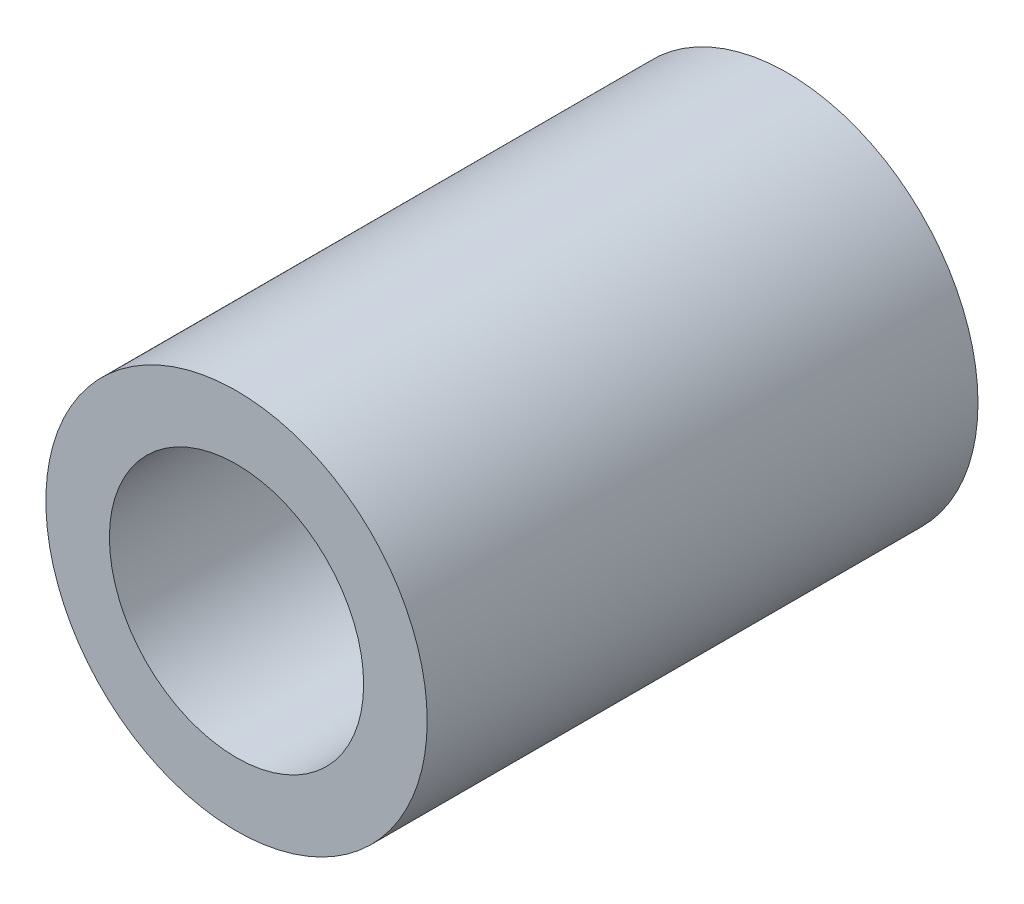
ISO-10303-21;
HEADER;
FILE_DESCRIPTION(('STEP AP214'),'2;1');
FILE_NAME('part.step','',(''),(''),'','','');
FILE_SCHEMA(('AUTOMOTIVE_DESIGN { 1 0 10303 214 1 1 1 1 }'));
ENDSEC;
DATA;
#1=APPLICATION_CONTEXT('core data for automotive mechanical design processes');
#2=APPLICATION_PROTOCOL_DEFINITION('international standard','automotive_design',2000,#1);
#3=PRODUCT_CONTEXT('',#1,'mechanical');
#4=PRODUCT('Part','Part','',(#3));
#5=PRODUCT_RELATED_PRODUCT_CATEGORY('part','',(#4));
#6=PRODUCT_DEFINITION_FORMATION('','',#4);
#7=PRODUCT_DEFINITION_CONTEXT('part definition',#1,'design');
#8=PRODUCT_DEFINITION('design','',#6,#7);
#9=PRODUCT_DEFINITION_SHAPE('','',#8);
#10=(LENGTH_UNIT() NAMED_UNIT(*) SI_UNIT(.MILLI.,.METRE.));
#11=(NAMED_UNIT(*) PLANE_ANGLE_UNIT() SI_UNIT($,.RADIAN.));
#12=(NAMED_UNIT(*) SI_UNIT($,.STERADIAN.) SOLID_ANGLE_UNIT());
#13=UNCERTAINTY_MEASURE_WITH_UNIT(LENGTH_MEASURE(1.E-05),#10,'distance_accuracy_value','');
#14=(GEOMETRIC_REPRESENTATION_CONTEXT(3) GLOBAL_UNCERTAINTY_ASSIGNED_CONTEXT((#13)) GLOBAL_UNIT_ASSIGNED_CONTEXT((#10,
#11,#12)) REPRESENTATION_CONTEXT('',''));
#15=CARTESIAN_POINT('',(0.,0.,0.));
#16=DIRECTION('',(0.,0.,1.));
#17=DIRECTION('',(1.,0.,0.));
#18=AXIS2_PLACEMENT_3D('',#15,#16,#17);
#19=CARTESIAN_POINT('',(0.,0.,32.5));
#20=DIRECTION('',(0.,0.,1.));
#21=DIRECTION('',(1.,0.,0.));
#22=AXIS2_PLACEMENT_3D('',#19,#20,#21);
#23=PLANE('',#22);
#24=CARTESIAN_POINT('',(0.,0.,32.5));
#25=DIRECTION('',(0.,0.,1.));
#26=DIRECTION('',(1.,0.,0.));
#27=AXIS2_PLACEMENT_3D('',#24,#25,#26);
#28=CIRCLE('',#27,22.5);
#29=CARTESIAN_POINT('',(22.5,0.,32.5));
#30=VERTEX_POINT('',#29);
#31=EDGE_CURVE('E10',#30,#30,#28,.T.);
#32=ORIENTED_EDGE('',*,*,#31,.T.);
#33=EDGE_LOOP('',(#32));
#34=FACE_BOUND('',#33,.T.);
#35=CARTESIAN_POINT('',(0.,0.,32.5));
#36=DIRECTION('',(0.,0.,1.));
#37=DIRECTION('',(1.,0.,0.));
#38=AXIS2_PLACEMENT_3D('',#35,#36,#37);
#39=CIRCLE('',#38,15.);
#40=CARTESIAN_POINT('',(15.,0.,32.5));
#41=VERTEX_POINT('',#40);
#42=EDGE_CURVE('E56',#41,#41,#39,.T.);
#43=ORIENTED_EDGE('',*,*,#42,.F.);
#44=EDGE_LOOP('',(#43));
#45=FACE_BOUND('',#44,.T.);
#46=ADVANCED_FACE('F37',(#34,#45),#23,.T.);
#47=CARTESIAN_POINT('',(0.,0.,-32.5));
#48=DIRECTION('',(0.,0.,1.));
#49=DIRECTION('',(1.,0.,0.));
#50=AXIS2_PLACEMENT_3D('',#47,#48,#49);
#51=PLANE('',#50);
#52=CARTESIAN_POINT('',(0.,0.,-32.5));
#53=DIRECTION('',(0.,0.,1.));
#54=DIRECTION('',(1.,0.,0.));
#55=AXIS2_PLACEMENT_3D('',#52,#53,#54);
#56=CIRCLE('',#55,22.5);
#57=CARTESIAN_POINT('',(22.5,0.,-32.5));
#58=VERTEX_POINT('',#57);
#59=EDGE_CURVE('E51',#58,#58,#56,.T.);
#60=ORIENTED_EDGE('',*,*,#59,.F.);
#61=EDGE_LOOP('',(#60));
#62=FACE_BOUND('',#61,.T.);
#63=CARTESIAN_POINT('',(0.,0.,-32.5));
#64=DIRECTION('',(0.,0.,1.));
#65=DIRECTION('',(1.,0.,0.));
#66=AXIS2_PLACEMENT_3D('',#63,#64,#65);
#67=CIRCLE('',#66,15.);
#68=CARTESIAN_POINT('',(15.,0.,-32.5));
#69=VERTEX_POINT('',#68);
#70=EDGE_CURVE('E58',#69,#69,#67,.T.);
#71=ORIENTED_EDGE('',*,*,#70,.T.);
#72=EDGE_LOOP('',(#71));
#73=FACE_BOUND('',#72,.T.);
#74=ADVANCED_FACE('F79',(#62,#73),#51,.F.);
#75=CARTESIAN_POINT('',(0.,0.,32.5));
#76=DIRECTION('',(0.,0.,-1.));
#77=DIRECTION('',(-1.,0.,0.));
#78=AXIS2_PLACEMENT_3D('',#75,#76,#77);
#79=CYLINDRICAL_SURFACE('',#78,22.5);
#80=CARTESIAN_POINT('',(0.,-22.5,4.));
#81=CARTESIAN_POINT('',(0.222799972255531,-22.499996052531,3.99999127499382));
#82=CARTESIAN_POINT('',(0.44571593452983,-22.4966563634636,3.98132216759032));
#83=CARTESIAN_POINT('',(0.885280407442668,-22.4836554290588,3.90717888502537));
#84=CARTESIAN_POINT('',(1.10192322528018,-22.4739886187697,3.85167230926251));
#85=CARTESIAN_POINT('',(1.52251954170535,-22.4494161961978,3.70559573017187));
#86=CARTESIAN_POINT('',(1.72648380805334,-22.4345151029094,3.61505596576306));
#87=CARTESIAN_POINT('',(2.11630409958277,-22.4011066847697,3.40156580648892));
#88=CARTESIAN_POINT('',(2.30216187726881,-22.3825997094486,3.27861855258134));
#89=CARTESIAN_POINT('',(2.65252607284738,-22.3438026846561,3.00239027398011));
#90=CARTESIAN_POINT('',(2.81680824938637,-22.3234971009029,2.84882697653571));
#91=CARTESIAN_POINT('',(3.11741933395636,-22.2835084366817,2.51633313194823));
#92=CARTESIAN_POINT('',(3.25374635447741,-22.2638253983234,2.33740087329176));
#93=CARTESIAN_POINT('',(3.49549375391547,-22.2271597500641,1.95768473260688));
#94=CARTESIAN_POINT('',(3.60068906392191,-22.2101971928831,1.75675545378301));
#95=CARTESIAN_POINT('',(3.7757468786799,-22.181110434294,1.33972525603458));
#96=CARTESIAN_POINT('',(3.84561211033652,-22.168985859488,1.12362550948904));
#97=CARTESIAN_POINT('',(3.94731313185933,-22.1511034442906,0.684777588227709));
#98=CARTESIAN_POINT('',(3.9795381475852,-22.1452804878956,0.462122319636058));
#99=CARTESIAN_POINT('',(4.00625148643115,-22.1404639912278,0.0144948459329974));
#100=CARTESIAN_POINT('',(4.00074284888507,-22.1414699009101,-0.210477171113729));
#101=CARTESIAN_POINT('',(3.95246154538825,-22.1501381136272,-0.653552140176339));
#102=CARTESIAN_POINT('',(3.91012888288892,-22.1577218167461,-0.871704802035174));
#103=CARTESIAN_POINT('',(3.79009297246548,-22.1785678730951,-1.29776134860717));
#104=CARTESIAN_POINT('',(3.71238836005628,-22.1918304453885,-1.50566483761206));
#105=CARTESIAN_POINT('',(3.52337643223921,-22.2226233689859,-1.90662315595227));
#106=CARTESIAN_POINT('',(3.41188903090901,-22.2401764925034,-2.09959127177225));
#107=CARTESIAN_POINT('',(3.15860383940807,-22.2775573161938,-2.46424740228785));
#108=CARTESIAN_POINT('',(3.0168032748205,-22.2973852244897,-2.63593346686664));
#109=CARTESIAN_POINT('',(2.70453259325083,-22.3374253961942,-2.9556964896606));
#110=CARTESIAN_POINT('',(2.53368555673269,-22.357639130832,-3.10340542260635));
#111=CARTESIAN_POINT('',(2.16943936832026,-22.3959150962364,-3.36811804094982));
#112=CARTESIAN_POINT('',(1.97604003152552,-22.4139773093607,-3.48512147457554));
#113=CARTESIAN_POINT('',(1.5718134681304,-22.4459461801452,-3.68514599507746));
#114=CARTESIAN_POINT('',(1.36096830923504,-22.4598484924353,-3.76813158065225));
#115=CARTESIAN_POINT('',(0.928029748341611,-22.48189700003,-3.89740740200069));
#116=CARTESIAN_POINT('',(0.705937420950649,-22.4900437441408,-3.94370113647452));
#117=CARTESIAN_POINT('',(0.259977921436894,-22.4995885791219,-3.99777331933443));
#118=CARTESIAN_POINT('',(0.0361737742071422,-22.5010750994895,-4.00605647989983));
#119=CARTESIAN_POINT('',(-0.409622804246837,-22.4973752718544,-3.9852222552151));
#120=CARTESIAN_POINT('',(-0.631615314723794,-22.4921892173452,-3.95610651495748));
#121=CARTESIAN_POINT('',(-1.06590632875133,-22.4757818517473,-3.86172071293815));
#122=CARTESIAN_POINT('',(-1.27826149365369,-22.4646027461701,-3.79670338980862));
#123=CARTESIAN_POINT('',(-1.68905751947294,-22.4374575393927,-3.63263156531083));
#124=CARTESIAN_POINT('',(-1.88749751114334,-22.4214911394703,-3.533574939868));
#125=CARTESIAN_POINT('',(-2.26700267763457,-22.386322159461,-3.30310064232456));
#126=CARTESIAN_POINT('',(-2.44787566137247,-22.3670890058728,-3.1713712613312));
#127=CARTESIAN_POINT('',(-2.78512961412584,-22.327604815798,-2.87971589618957));
#128=CARTESIAN_POINT('',(-2.94150854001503,-22.3073536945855,-2.71978756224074));
#129=CARTESIAN_POINT('',(-3.22723071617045,-22.2678261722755,-2.37399912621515));
#130=CARTESIAN_POINT('',(-3.35623113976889,-22.2485641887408,-2.18785383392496));
#131=CARTESIAN_POINT('',(-3.58113186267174,-22.213475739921,-1.79623885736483));
#132=CARTESIAN_POINT('',(-3.67703331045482,-22.1976491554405,-1.59076984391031));
#133=CARTESIAN_POINT('',(-3.83251482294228,-22.1713342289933,-1.16725262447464));
#134=CARTESIAN_POINT('',(-3.89225850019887,-22.1608218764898,-0.949266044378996));
#135=CARTESIAN_POINT('',(-3.9742383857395,-22.1462681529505,-0.506146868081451));
#136=CARTESIAN_POINT('',(-3.99647835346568,-22.1422261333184,-0.281014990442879));
#137=CARTESIAN_POINT('',(-4.00270371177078,-22.1411012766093,0.166575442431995));
#138=CARTESIAN_POINT('',(-3.98722928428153,-22.1439201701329,0.389026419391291));
#139=CARTESIAN_POINT('',(-3.91964074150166,-22.155982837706,0.828103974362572));
#140=CARTESIAN_POINT('',(-3.86752679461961,-22.1652265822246,1.04473057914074));
#141=CARTESIAN_POINT('',(-3.72835652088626,-22.1890579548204,1.4657587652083));
#142=CARTESIAN_POINT('',(-3.64135294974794,-22.2036375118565,1.67017827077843));
#143=CARTESIAN_POINT('',(-3.43493037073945,-22.236504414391,2.06160607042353));
#144=CARTESIAN_POINT('',(-3.31550939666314,-22.2547919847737,2.24861330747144));
#145=CARTESIAN_POINT('',(-3.04573986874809,-22.2933225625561,2.60262536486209));
#146=CARTESIAN_POINT('',(-2.89499607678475,-22.3135886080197,2.7693265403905));
#147=CARTESIAN_POINT('',(-2.56768910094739,-22.3536149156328,3.07524963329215));
#148=CARTESIAN_POINT('',(-2.3911199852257,-22.3733750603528,3.21446522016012));
#149=CARTESIAN_POINT('',(-2.01549319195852,-22.4103470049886,3.46249244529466));
#150=CARTESIAN_POINT('',(-1.81626741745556,-22.4275372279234,3.5710527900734));
#151=CARTESIAN_POINT('',(-1.40217241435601,-22.4572223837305,3.75299289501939));
#152=CARTESIAN_POINT('',(-1.18731854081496,-22.4697218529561,3.82640666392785));
#153=CARTESIAN_POINT('',(-0.809776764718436,-22.4859820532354,3.920566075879));
#154=CARTESIAN_POINT('',(-0.649334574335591,-22.4912098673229,3.9503044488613));
#155=CARTESIAN_POINT('',(-0.325948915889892,-22.498220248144,3.99002439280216));
#156=CARTESIAN_POINT('',(-0.163005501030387,-22.5000028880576,4.00000638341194));
#157=CARTESIAN_POINT('',(0.,-22.5,4.));
#158=B_SPLINE_CURVE_WITH_KNOTS('',3,(#80,#81,#82,#83,#84,#85,#86,#87,#88,#89,#90,#91,#92,#93,
#94,#95,#96,#97,#98,#99,#100,#101,#102,#103,#104,#105,#106,#107,#108,#109,#110,#111,#112,#113,
#114,#115,#116,#117,#118,#119,#120,#121,#122,#123,#124,#125,#126,#127,#128,#129,#130,#131,#132,
#133,#134,#135,#136,#137,#138,#139,#140,#141,#142,#143,#144,#145,#146,#147,#148,#149,#150,#151,
#152,#153,#154,#155,#156,#157),.UNSPECIFIED.,.T.,.F.,(4,2,2,2,2,2,2,2,2,2,2,2,2,2,2,2,2,2,2,2,2,
2,2,2,2,2,2,2,2,2,2,2,2,2,2,2,2,2,4),(0.,0.667803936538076,1.33619602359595,2.00401246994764,
2.6717642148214,3.34598367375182,4.02024864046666,4.69927541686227,5.37824977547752,
6.05013910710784,6.72197432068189,7.38589048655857,8.04983226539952,8.71737751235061,
9.3849838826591,10.0620270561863,10.7390757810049,11.4168292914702,12.0945181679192,
12.7631820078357,13.4318164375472,14.0958027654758,14.7598305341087,15.4304549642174,
16.1011353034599,16.7797739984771,17.4583891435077,18.1339101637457,18.809363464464,
19.4751992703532,20.1410320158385,20.8058617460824,21.4707318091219,22.1445651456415,
22.8185534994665,23.4979162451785,24.1766202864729,24.6652111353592,25.1537916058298),.UNSPECIFIED.);
#159=CARTESIAN_POINT('',(0.,-22.5,4.));
#160=VERTEX_POINT('',#159);
#161=EDGE_CURVE('E61',#160,#160,#158,.T.);
#162=ORIENTED_EDGE('',*,*,#161,.T.);
#163=EDGE_LOOP('',(#162));
#164=FACE_BOUND('',#163,.T.);
#165=ORIENTED_EDGE('',*,*,#31,.F.);
#166=EDGE_LOOP('',(#165));
#167=FACE_BOUND('',#166,.T.);
#168=ORIENTED_EDGE('',*,*,#59,.T.);
#169=EDGE_LOOP('',(#168));
#170=FACE_BOUND('',#169,.T.);
#171=ADVANCED_FACE('F39',(#164,#167,#170),#79,.T.);
#172=CARTESIAN_POINT('',(0.,0.,32.5));
#173=DIRECTION('',(0.,0.,-1.));
#174=DIRECTION('',(-1.,0.,0.));
#175=AXIS2_PLACEMENT_3D('',#172,#173,#174);
#176=CYLINDRICAL_SURFACE('',#175,15.);
#177=CARTESIAN_POINT('',(0.,-15.,4.));
#178=CARTESIAN_POINT('',(0.220509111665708,-14.9999966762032,3.9999947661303));
#179=CARTESIAN_POINT('',(0.441074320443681,-14.995089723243,3.98170477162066));
#180=CARTESIAN_POINT('',(0.875850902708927,-14.9759914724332,3.90915753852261));
#181=CARTESIAN_POINT('',(1.09005916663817,-14.9617957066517,3.85488299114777));
#182=CARTESIAN_POINT('',(1.50578317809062,-14.9256866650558,3.71225666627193));
#183=CARTESIAN_POINT('',(1.70731490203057,-14.9037833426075,3.62394882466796));
#184=CARTESIAN_POINT('',(2.09270737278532,-14.8545739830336,3.41592551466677));
#185=CARTESIAN_POINT('',(2.27656694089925,-14.8272675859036,3.29620795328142));
#186=CARTESIAN_POINT('',(2.62565900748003,-14.7694922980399,3.02583296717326));
#187=CARTESIAN_POINT('',(2.79042337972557,-14.7389693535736,2.87458266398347));
#188=CARTESIAN_POINT('',(3.09257427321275,-14.6785481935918,2.54670303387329));
#189=CARTESIAN_POINT('',(3.22995726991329,-14.6486500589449,2.37007044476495));
#190=CARTESIAN_POINT('',(3.4757281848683,-14.5923107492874,1.9927035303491));
#191=CARTESIAN_POINT('',(3.58357755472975,-14.5659377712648,1.79160734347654));
#192=CARTESIAN_POINT('',(3.76375096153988,-14.5204295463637,1.37331977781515));
#193=CARTESIAN_POINT('',(3.83608154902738,-14.5012929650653,1.15613137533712));
#194=CARTESIAN_POINT('',(3.94153840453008,-14.472982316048,0.71700892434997));
#195=CARTESIAN_POINT('',(3.97551340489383,-14.4635929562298,0.495292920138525));
#196=CARTESIAN_POINT('',(4.00594069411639,-14.4551966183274,0.04912463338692));
#197=CARTESIAN_POINT('',(4.00239999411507,-14.4561877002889,-0.175327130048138));
#198=CARTESIAN_POINT('',(3.95857020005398,-14.4682475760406,-0.613970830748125));
#199=CARTESIAN_POINT('',(3.91930812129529,-14.4790347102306,-0.828274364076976));
#200=CARTESIAN_POINT('',(3.80679497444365,-14.5090202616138,-1.24713666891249));
#201=CARTESIAN_POINT('',(3.73354118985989,-14.5282193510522,-1.45169466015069));
#202=CARTESIAN_POINT('',(3.55428713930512,-14.5731132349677,-1.84793628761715));
#203=CARTESIAN_POINT('',(3.44792682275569,-14.5988788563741,-2.03944867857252));
#204=CARTESIAN_POINT('',(3.20573007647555,-14.6539645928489,-2.40226831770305));
#205=CARTESIAN_POINT('',(3.06988784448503,-14.6832854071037,-2.57357157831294));
#206=CARTESIAN_POINT('',(2.76733214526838,-14.7433502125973,-2.8969779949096));
#207=CARTESIAN_POINT('',(2.59975625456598,-14.7741094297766,-3.04827263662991));
#208=CARTESIAN_POINT('',(2.24123533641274,-14.8327276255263,-3.32077756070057));
#209=CARTESIAN_POINT('',(2.05028938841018,-14.8605864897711,-3.44198665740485));
#210=CARTESIAN_POINT('',(1.6491965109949,-14.9104364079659,-3.6512358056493));
#211=CARTESIAN_POINT('',(1.43896980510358,-14.9324014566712,-3.73912954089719));
#212=CARTESIAN_POINT('',(1.00600458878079,-14.96780088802,-3.87809437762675));
#213=CARTESIAN_POINT('',(0.783268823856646,-14.981237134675,-3.92917352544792));
#214=CARTESIAN_POINT('',(0.338508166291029,-14.9977831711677,-3.99178975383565));
#215=CARTESIAN_POINT('',(0.116648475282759,-15.0011799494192,-4.00442607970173));
#216=CARTESIAN_POINT('',(-0.326020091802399,-14.9980894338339,-3.99283367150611));
#217=CARTESIAN_POINT('',(-0.546829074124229,-14.9916031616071,-3.96860874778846));
#218=CARTESIAN_POINT('',(-0.97720489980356,-14.9696607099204,-3.88488310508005));
#219=CARTESIAN_POINT('',(-1.18689970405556,-14.9543605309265,-3.82599550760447));
#220=CARTESIAN_POINT('',(-1.59341394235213,-14.9165258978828,-3.67532811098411));
#221=CARTESIAN_POINT('',(-1.79023197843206,-14.8939906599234,-3.58354474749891));
#222=CARTESIAN_POINT('',(-2.1696769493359,-14.8435132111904,-3.36765222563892));
#223=CARTESIAN_POINT('',(-2.35195037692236,-14.8154737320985,-3.2429450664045));
#224=CARTESIAN_POINT('',(-2.6933692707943,-14.7572290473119,-2.96549673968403));
#225=CARTESIAN_POINT('',(-2.85251015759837,-14.7270234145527,-2.81275003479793));
#226=CARTESIAN_POINT('',(-3.14777848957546,-14.6667949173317,-2.47842884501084));
#227=CARTESIAN_POINT('',(-3.28313038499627,-14.6368012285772,-2.29616287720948));
#228=CARTESIAN_POINT('',(-3.52134382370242,-14.5813289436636,-1.91087060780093));
#229=CARTESIAN_POINT('',(-3.62420672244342,-14.5558501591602,-1.70784517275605));
#230=CARTESIAN_POINT('',(-3.79374823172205,-14.5125853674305,-1.28780938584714));
#231=CARTESIAN_POINT('',(-3.8606362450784,-14.4947549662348,-1.07088837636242));
#232=CARTESIAN_POINT('',(-3.95682410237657,-14.4687965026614,-0.628321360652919));
#233=CARTESIAN_POINT('',(-3.98613355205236,-14.4606659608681,-0.402677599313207));
#234=CARTESIAN_POINT('',(-4.00577979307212,-14.4552348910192,0.0429895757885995));
#235=CARTESIAN_POINT('',(-3.99736311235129,-14.4575879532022,0.262954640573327));
#236=CARTESIAN_POINT('',(-3.94468751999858,-14.4720479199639,0.698207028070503));
#237=CARTESIAN_POINT('',(-3.9004295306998,-14.4841545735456,0.913494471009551));
#238=CARTESIAN_POINT('',(-3.77805031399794,-14.5165514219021,1.33171150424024));
#239=CARTESIAN_POINT('',(-3.70019322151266,-14.5367777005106,1.53472368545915));
#240=CARTESIAN_POINT('',(-3.51303109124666,-14.5831363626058,1.9249576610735));
#241=CARTESIAN_POINT('',(-3.40372112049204,-14.6092696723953,2.11217697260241));
#242=CARTESIAN_POINT('',(-3.15297818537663,-14.6654584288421,2.47146071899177));
#243=CARTESIAN_POINT('',(-3.01069459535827,-14.6956066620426,2.64291706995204));
#244=CARTESIAN_POINT('',(-2.69966107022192,-14.7559100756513,2.95992490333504));
#245=CARTESIAN_POINT('',(-2.53090470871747,-14.7860652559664,3.10547007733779));
#246=CARTESIAN_POINT('',(-2.16735996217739,-14.8437562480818,3.36958447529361));
#247=CARTESIAN_POINT('',(-1.97209192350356,-14.8712222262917,3.48751002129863));
#248=CARTESIAN_POINT('',(-1.56377728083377,-14.9196762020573,3.68867483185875));
#249=CARTESIAN_POINT('',(-1.35074218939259,-14.9406683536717,3.77193635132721));
#250=CARTESIAN_POINT('',(-0.948749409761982,-14.9710950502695,3.89055057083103));
#251=CARTESIAN_POINT('',(-0.761524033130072,-14.9818554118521,3.93149876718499));
#252=CARTESIAN_POINT('',(-0.382879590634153,-14.9963089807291,3.98622441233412));
#253=CARTESIAN_POINT('',(-0.191460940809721,-15.0000028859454,4.00000454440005));
#254=CARTESIAN_POINT('',(0.,-15.,4.));
#255=B_SPLINE_CURVE_WITH_KNOTS('',3,(#177,#178,#179,#180,#181,#182,#183,#184,#185,#186,#187,
#188,#189,#190,#191,#192,#193,#194,#195,#196,#197,#198,#199,#200,#201,#202,#203,#204,#205,#206,
#207,#208,#209,#210,#211,#212,#213,#214,#215,#216,#217,#218,#219,#220,#221,#222,#223,#224,#225,
#226,#227,#228,#229,#230,#231,#232,#233,#234,#235,#236,#237,#238,#239,#240,#241,#242,#243,#244,
#245,#246,#247,#248,#249,#250,#251,#252,#253,#254),.UNSPECIFIED.,.T.,.F.,(4,2,2,2,2,2,2,2,2,2,2,
2,2,2,2,2,2,2,2,2,2,2,2,2,2,2,2,2,2,2,2,2,2,2,2,2,2,2,4),(0.,0.660825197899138,1.3219684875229,
1.98226110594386,2.6425977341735,3.31669795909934,3.99088489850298,4.67665165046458,
5.36229188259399,6.03244316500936,6.7024692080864,7.35382004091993,8.00522293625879,
8.66397346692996,9.3228537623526,10.0032251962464,10.6836234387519,11.3669761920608,
12.0501795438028,12.7136543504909,13.377060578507,14.0290707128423,14.6811515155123,
15.346005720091,16.0109913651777,16.6947299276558,17.3784399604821,18.0581259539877,
18.7376381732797,19.394866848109,20.0520786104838,20.7042153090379,21.3564543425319,
22.0278867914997,22.6994824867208,23.3854450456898,24.0709665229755,24.6447963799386,
25.2185695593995),.UNSPECIFIED.);
#256=CARTESIAN_POINT('',(0.,-15.,4.));
#257=VERTEX_POINT('',#256);
#258=EDGE_CURVE('E42',#257,#257,#255,.T.);
#259=ORIENTED_EDGE('',*,*,#258,.F.);
#260=EDGE_LOOP('',(#259));
#261=FACE_BOUND('',#260,.T.);
#262=ORIENTED_EDGE('',*,*,#42,.T.);
#263=EDGE_LOOP('',(#262));
#264=FACE_BOUND('',#263,.T.);
#265=ORIENTED_EDGE('',*,*,#70,.F.);
#266=EDGE_LOOP('',(#265));
#267=FACE_BOUND('',#266,.T.);
#268=ADVANCED_FACE('F71',(#261,#264,#267),#176,.F.);
#269=CARTESIAN_POINT('',(0.,-60.,0.));
#270=DIRECTION('',(0.,1.,0.));
#271=DIRECTION('',(0.,0.,1.));
#272=AXIS2_PLACEMENT_3D('',#269,#270,#271);
#273=CYLINDRICAL_SURFACE('',#272,4.);
#274=ORIENTED_EDGE('',*,*,#258,.T.);
#275=EDGE_LOOP('',(#274));
#276=FACE_BOUND('',#275,.T.);
#277=ORIENTED_EDGE('',*,*,#161,.F.);
#278=EDGE_LOOP('',(#277));
#279=FACE_BOUND('',#278,.T.);
#280=ADVANCED_FACE('F68',(#276,#279),#273,.F.);
#281=CLOSED_SHELL('',(#46,#74,#171,#268,#280));
#282=MANIFOLD_SOLID_BREP('B2',#281);
#283=ADVANCED_BREP_SHAPE_REPRESENTATION('',(#18,#282),#14);
#284=SHAPE_DEFINITION_REPRESENTATION(#9,#283);
ENDSEC;
END-ISO-10303-21;
